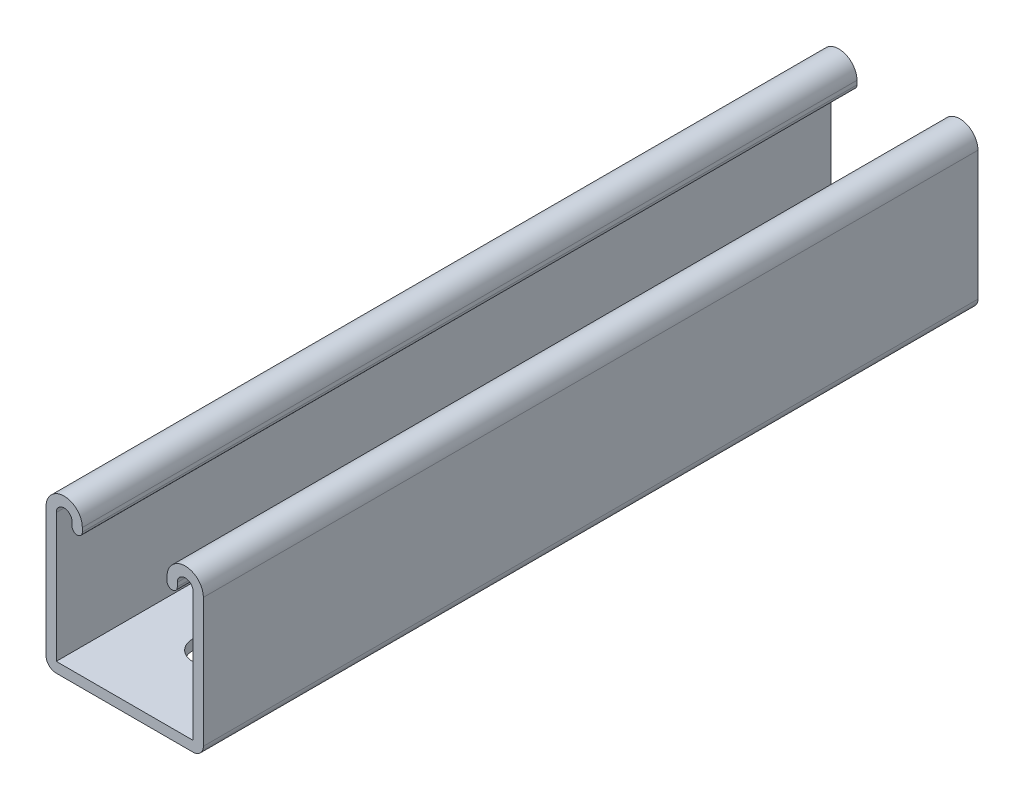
ISO-10303-21;
HEADER;
FILE_DESCRIPTION(('STEP AP214'),'2;1');
FILE_NAME('part.step','',(''),(''),'','','');
FILE_SCHEMA(('AUTOMOTIVE_DESIGN { 1 0 10303 214 1 1 1 1 }'));
ENDSEC;
DATA;
#1=APPLICATION_CONTEXT('core data for automotive mechanical design processes');
#2=APPLICATION_PROTOCOL_DEFINITION('international standard','automotive_design',2000,#1);
#3=PRODUCT_CONTEXT('',#1,'mechanical');
#4=PRODUCT('Part','Part','',(#3));
#5=PRODUCT_RELATED_PRODUCT_CATEGORY('part','',(#4));
#6=PRODUCT_DEFINITION_FORMATION('','',#4);
#7=PRODUCT_DEFINITION_CONTEXT('part definition',#1,'design');
#8=PRODUCT_DEFINITION('design','',#6,#7);
#9=PRODUCT_DEFINITION_SHAPE('','',#8);
#10=(LENGTH_UNIT() NAMED_UNIT(*) SI_UNIT(.MILLI.,.METRE.));
#11=(NAMED_UNIT(*) PLANE_ANGLE_UNIT() SI_UNIT($,.RADIAN.));
#12=(NAMED_UNIT(*) SI_UNIT($,.STERADIAN.) SOLID_ANGLE_UNIT());
#13=UNCERTAINTY_MEASURE_WITH_UNIT(LENGTH_MEASURE(1.E-05),#10,'distance_accuracy_value','');
#14=(GEOMETRIC_REPRESENTATION_CONTEXT(3) GLOBAL_UNCERTAINTY_ASSIGNED_CONTEXT((#13)) GLOBAL_UNIT_ASSIGNED_CONTEXT((#10,
#11,#12)) REPRESENTATION_CONTEXT('',''));
#15=CARTESIAN_POINT('',(0.,0.,0.));
#16=DIRECTION('',(0.,0.,1.));
#17=DIRECTION('',(1.,0.,0.));
#18=AXIS2_PLACEMENT_3D('',#15,#16,#17);
#19=CARTESIAN_POINT('',(-15.875,18.4785,203.2));
#20=DIRECTION('',(0.,0.,-1.));
#21=DIRECTION('',(-1.,0.,0.));
#22=AXIS2_PLACEMENT_3D('',#19,#20,#21);
#23=CYLINDRICAL_SURFACE('',#22,4.7625);
#24=CARTESIAN_POINT('',(-15.875,18.4785,0.));
#25=DIRECTION('',(0.,0.,1.));
#26=DIRECTION('',(-1.,0.,0.));
#27=AXIS2_PLACEMENT_3D('',#24,#25,#26);
#28=CIRCLE('',#27,4.7625);
#29=CARTESIAN_POINT('',(-11.1125,18.4785,0.));
#30=VERTEX_POINT('',#29);
#31=CARTESIAN_POINT('',(-20.6375,18.4785,0.));
#32=VERTEX_POINT('',#31);
#33=EDGE_CURVE('E260',#30,#32,#28,.T.);
#34=ORIENTED_EDGE('',*,*,#33,.T.);
#35=DIRECTION('',(0.,0.,-1.));
#36=VECTOR('',#35,1.);
#37=CARTESIAN_POINT('',(-20.6375,18.4785,203.2));
#38=LINE('',#37,#36);
#39=CARTESIAN_POINT('',(-20.6375,18.4785,203.2));
#40=VERTEX_POINT('',#39);
#41=EDGE_CURVE('E391',#40,#32,#38,.T.);
#42=ORIENTED_EDGE('',*,*,#41,.F.);
#43=CARTESIAN_POINT('',(-15.875,18.4785,203.2));
#44=DIRECTION('',(0.,0.,1.));
#45=DIRECTION('',(-1.,0.,0.));
#46=AXIS2_PLACEMENT_3D('',#43,#44,#45);
#47=CIRCLE('',#46,4.7625);
#48=CARTESIAN_POINT('',(-11.1125,18.4785,203.2));
#49=VERTEX_POINT('',#48);
#50=EDGE_CURVE('E267',#49,#40,#47,.T.);
#51=ORIENTED_EDGE('',*,*,#50,.F.);
#52=DIRECTION('',(0.,0.,-1.));
#53=VECTOR('',#52,1.);
#54=CARTESIAN_POINT('',(-11.1125,18.4785,203.2));
#55=LINE('',#54,#53);
#56=EDGE_CURVE('E305',#49,#30,#55,.T.);
#57=ORIENTED_EDGE('',*,*,#56,.T.);
#58=EDGE_LOOP('',(#34,#42,#51,#57));
#59=FACE_BOUND('',#58,.T.);
#60=ADVANCED_FACE('F39',(#59),#23,.T.);
#61=CARTESIAN_POINT('',(-20.6375,18.4785,203.2));
#62=DIRECTION('',(1.,0.,0.));
#63=DIRECTION('',(0.,1.,0.));
#64=AXIS2_PLACEMENT_3D('',#61,#62,#63);
#65=PLANE('',#64);
#66=DIRECTION('',(0.,-1.,0.));
#67=VECTOR('',#66,1.);
#68=CARTESIAN_POINT('',(-20.6375,18.4785,0.));
#69=LINE('',#68,#67);
#70=CARTESIAN_POINT('',(-20.6375,-15.3416,0.));
#71=VERTEX_POINT('',#70);
#72=EDGE_CURVE('E308',#32,#71,#69,.T.);
#73=ORIENTED_EDGE('',*,*,#72,.T.);
#74=DIRECTION('',(0.,0.,-1.));
#75=VECTOR('',#74,1.);
#76=CARTESIAN_POINT('',(-20.6375,-15.3416,203.2));
#77=LINE('',#76,#75);
#78=CARTESIAN_POINT('',(-20.6375,-15.3416,203.2));
#79=VERTEX_POINT('',#78);
#80=EDGE_CURVE('E388',#79,#71,#77,.T.);
#81=ORIENTED_EDGE('',*,*,#80,.F.);
#82=DIRECTION('',(0.,-1.,0.));
#83=VECTOR('',#82,1.);
#84=CARTESIAN_POINT('',(-20.6375,18.4785,203.2));
#85=LINE('',#84,#83);
#86=EDGE_CURVE('E270',#40,#79,#85,.T.);
#87=ORIENTED_EDGE('',*,*,#86,.F.);
#88=ORIENTED_EDGE('',*,*,#41,.T.);
#89=EDGE_LOOP('',(#73,#81,#87,#88));
#90=FACE_BOUND('',#89,.T.);
#91=ADVANCED_FACE('F433',(#90),#65,.F.);
#92=CARTESIAN_POINT('',(-17.9451,-15.3416,203.2));
#93=DIRECTION('',(0.,0.,-1.));
#94=DIRECTION('',(-1.,0.,0.));
#95=AXIS2_PLACEMENT_3D('',#92,#93,#94);
#96=CYLINDRICAL_SURFACE('',#95,2.6924);
#97=CARTESIAN_POINT('',(-17.9451,-15.3416,0.));
#98=DIRECTION('',(0.,0.,1.));
#99=DIRECTION('',(-1.,0.,0.));
#100=AXIS2_PLACEMENT_3D('',#97,#98,#99);
#101=CIRCLE('',#100,2.6924);
#102=CARTESIAN_POINT('',(-17.9451,-18.034,0.));
#103=VERTEX_POINT('',#102);
#104=EDGE_CURVE('E310',#71,#103,#101,.T.);
#105=ORIENTED_EDGE('',*,*,#104,.T.);
#106=DIRECTION('',(0.,0.,-1.));
#107=VECTOR('',#106,1.);
#108=CARTESIAN_POINT('',(-17.9451,-18.034,203.2));
#109=LINE('',#108,#107);
#110=CARTESIAN_POINT('',(-17.9451,-18.034,203.2));
#111=VERTEX_POINT('',#110);
#112=EDGE_CURVE('E385',#111,#103,#109,.T.);
#113=ORIENTED_EDGE('',*,*,#112,.F.);
#114=CARTESIAN_POINT('',(-17.9451,-15.3416,203.2));
#115=DIRECTION('',(0.,0.,1.));
#116=DIRECTION('',(-1.,0.,0.));
#117=AXIS2_PLACEMENT_3D('',#114,#115,#116);
#118=CIRCLE('',#117,2.6924);
#119=EDGE_CURVE('E273',#79,#111,#118,.T.);
#120=ORIENTED_EDGE('',*,*,#119,.F.);
#121=ORIENTED_EDGE('',*,*,#80,.T.);
#122=EDGE_LOOP('',(#105,#113,#120,#121));
#123=FACE_BOUND('',#122,.T.);
#124=ADVANCED_FACE('F438',(#123),#96,.T.);
#125=CARTESIAN_POINT('',(-17.9451,-18.034,203.2));
#126=DIRECTION('',(0.,1.,0.));
#127=DIRECTION('',(-1.,0.,0.));
#128=AXIS2_PLACEMENT_3D('',#125,#126,#127);
#129=PLANE('',#128);
#130=DIRECTION('',(0.,0.,-1.));
#131=VECTOR('',#130,1.);
#132=CARTESIAN_POINT('',(-5.159375,-18.0340000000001,114.3));
#133=LINE('',#132,#131);
#134=CARTESIAN_POINT('',(-5.15937500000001,-18.034,180.18125));
#135=VERTEX_POINT('',#134);
#136=CARTESIAN_POINT('',(-5.159375,-18.0340000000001,114.3));
#137=VERTEX_POINT('',#136);
#138=EDGE_CURVE('E213',#135,#137,#133,.T.);
#139=ORIENTED_EDGE('',*,*,#138,.F.);
#140=CARTESIAN_POINT('',(0.,-18.0340000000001,180.18125));
#141=DIRECTION('',(0.,-1.,0.));
#142=DIRECTION('',(1.,0.,0.));
#143=AXIS2_PLACEMENT_3D('',#140,#141,#142);
#144=CIRCLE('',#143,5.159375);
#145=CARTESIAN_POINT('',(5.159375,-18.0340000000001,180.18125));
#146=VERTEX_POINT('',#145);
#147=EDGE_CURVE('E53',#146,#135,#144,.T.);
#148=ORIENTED_EDGE('',*,*,#147,.F.);
#149=DIRECTION('',(0.,0.,1.));
#150=VECTOR('',#149,1.);
#151=CARTESIAN_POINT('',(5.159375,-18.0340000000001,180.18125));
#152=LINE('',#151,#150);
#153=CARTESIAN_POINT('',(5.159375,-18.0340000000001,114.3));
#154=VERTEX_POINT('',#153);
#155=EDGE_CURVE('E229',#154,#146,#152,.T.);
#156=ORIENTED_EDGE('',*,*,#155,.F.);
#157=CARTESIAN_POINT('',(0.,-18.0340000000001,114.3));
#158=DIRECTION('',(0.,-1.,0.));
#159=DIRECTION('',(1.,0.,0.));
#160=AXIS2_PLACEMENT_3D('',#157,#158,#159);
#161=CIRCLE('',#160,5.159375);
#162=EDGE_CURVE('E223',#137,#154,#161,.T.);
#163=ORIENTED_EDGE('',*,*,#162,.F.);
#164=EDGE_LOOP('',(#139,#148,#156,#163));
#165=FACE_BOUND('',#164,.T.);
#166=DIRECTION('',(0.,0.,-1.));
#167=VECTOR('',#166,1.);
#168=CARTESIAN_POINT('',(-5.159375,-18.0340000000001,12.7));
#169=LINE('',#168,#167);
#170=CARTESIAN_POINT('',(-5.15937500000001,-18.034,78.58125));
#171=VERTEX_POINT('',#170);
#172=CARTESIAN_POINT('',(-5.159375,-18.0340000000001,12.7));
#173=VERTEX_POINT('',#172);
#174=EDGE_CURVE('E248',#171,#173,#169,.T.);
#175=ORIENTED_EDGE('',*,*,#174,.F.);
#176=CARTESIAN_POINT('',(0.,-18.0340000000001,78.58125));
#177=DIRECTION('',(0.,-1.,0.));
#178=DIRECTION('',(1.,0.,0.));
#179=AXIS2_PLACEMENT_3D('',#176,#177,#178);
#180=CIRCLE('',#179,5.159375);
#181=CARTESIAN_POINT('',(5.159375,-18.0340000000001,78.58125));
#182=VERTEX_POINT('',#181);
#183=EDGE_CURVE('E246',#182,#171,#180,.T.);
#184=ORIENTED_EDGE('',*,*,#183,.F.);
#185=DIRECTION('',(0.,0.,1.));
#186=VECTOR('',#185,1.);
#187=CARTESIAN_POINT('',(5.159375,-18.0340000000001,78.58125));
#188=LINE('',#187,#186);
#189=CARTESIAN_POINT('',(5.159375,-18.0340000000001,12.7));
#190=VERTEX_POINT('',#189);
#191=EDGE_CURVE('E254',#190,#182,#188,.T.);
#192=ORIENTED_EDGE('',*,*,#191,.F.);
#193=CARTESIAN_POINT('',(0.,-18.0340000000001,12.7));
#194=DIRECTION('',(0.,-1.,0.));
#195=DIRECTION('',(1.,0.,0.));
#196=AXIS2_PLACEMENT_3D('',#193,#194,#195);
#197=CIRCLE('',#196,5.159375);
#198=EDGE_CURVE('E251',#173,#190,#197,.T.);
#199=ORIENTED_EDGE('',*,*,#198,.F.);
#200=EDGE_LOOP('',(#175,#184,#192,#199));
#201=FACE_BOUND('',#200,.T.);
#202=DIRECTION('',(1.,0.,0.));
#203=VECTOR('',#202,1.);
#204=CARTESIAN_POINT('',(-17.9451,-18.034,0.));
#205=LINE('',#204,#203);
#206=CARTESIAN_POINT('',(17.9451,-18.034,0.));
#207=VERTEX_POINT('',#206);
#208=EDGE_CURVE('E312',#103,#207,#205,.T.);
#209=ORIENTED_EDGE('',*,*,#208,.T.);
#210=DIRECTION('',(0.,0.,-1.));
#211=VECTOR('',#210,1.);
#212=CARTESIAN_POINT('',(17.9451,-18.034,203.2));
#213=LINE('',#212,#211);
#214=CARTESIAN_POINT('',(17.9451,-18.034,203.2));
#215=VERTEX_POINT('',#214);
#216=EDGE_CURVE('E382',#215,#207,#213,.T.);
#217=ORIENTED_EDGE('',*,*,#216,.F.);
#218=DIRECTION('',(1.,0.,0.));
#219=VECTOR('',#218,1.);
#220=CARTESIAN_POINT('',(-17.9451,-18.034,203.2));
#221=LINE('',#220,#219);
#222=EDGE_CURVE('E275',#111,#215,#221,.T.);
#223=ORIENTED_EDGE('',*,*,#222,.F.);
#224=ORIENTED_EDGE('',*,*,#112,.T.);
#225=EDGE_LOOP('',(#209,#217,#223,#224));
#226=FACE_BOUND('',#225,.T.);
#227=ADVANCED_FACE('F227',(#165,#201,#226),#129,.F.);
#228=CARTESIAN_POINT('',(17.9451,-15.3416,203.2));
#229=DIRECTION('',(0.,0.,-1.));
#230=DIRECTION('',(-1.,0.,0.));
#231=AXIS2_PLACEMENT_3D('',#228,#229,#230);
#232=CYLINDRICAL_SURFACE('',#231,2.6924);
#233=CARTESIAN_POINT('',(17.9451,-15.3416,0.));
#234=DIRECTION('',(0.,0.,1.));
#235=DIRECTION('',(1.,0.,0.));
#236=AXIS2_PLACEMENT_3D('',#233,#234,#235);
#237=CIRCLE('',#236,2.6924);
#238=CARTESIAN_POINT('',(20.6375,-15.3416,0.));
#239=VERTEX_POINT('',#238);
#240=EDGE_CURVE('E314',#207,#239,#237,.T.);
#241=ORIENTED_EDGE('',*,*,#240,.T.);
#242=DIRECTION('',(0.,0.,-1.));
#243=VECTOR('',#242,1.);
#244=CARTESIAN_POINT('',(20.6375,-15.3416,203.2));
#245=LINE('',#244,#243);
#246=CARTESIAN_POINT('',(20.6375,-15.3416,203.2));
#247=VERTEX_POINT('',#246);
#248=EDGE_CURVE('E379',#247,#239,#245,.T.);
#249=ORIENTED_EDGE('',*,*,#248,.F.);
#250=CARTESIAN_POINT('',(17.9451,-15.3416,203.2));
#251=DIRECTION('',(0.,0.,1.));
#252=DIRECTION('',(1.,0.,0.));
#253=AXIS2_PLACEMENT_3D('',#250,#251,#252);
#254=CIRCLE('',#253,2.6924);
#255=EDGE_CURVE('E277',#215,#247,#254,.T.);
#256=ORIENTED_EDGE('',*,*,#255,.F.);
#257=ORIENTED_EDGE('',*,*,#216,.T.);
#258=EDGE_LOOP('',(#241,#249,#256,#257));
#259=FACE_BOUND('',#258,.T.);
#260=ADVANCED_FACE('F518',(#259),#232,.T.);
#261=CARTESIAN_POINT('',(20.6375,-15.3416,203.2));
#262=DIRECTION('',(-1.,0.,0.));
#263=DIRECTION('',(0.,0.,1.));
#264=AXIS2_PLACEMENT_3D('',#261,#262,#263);
#265=PLANE('',#264);
#266=DIRECTION('',(0.,1.,0.));
#267=VECTOR('',#266,1.);
#268=CARTESIAN_POINT('',(20.6375,-15.3416,0.));
#269=LINE('',#268,#267);
#270=CARTESIAN_POINT('',(20.6375,18.4785,0.));
#271=VERTEX_POINT('',#270);
#272=EDGE_CURVE('E316',#239,#271,#269,.T.);
#273=ORIENTED_EDGE('',*,*,#272,.T.);
#274=DIRECTION('',(0.,0.,-1.));
#275=VECTOR('',#274,1.);
#276=CARTESIAN_POINT('',(20.6375,18.4785,203.2));
#277=LINE('',#276,#275);
#278=CARTESIAN_POINT('',(20.6375,18.4785,203.2));
#279=VERTEX_POINT('',#278);
#280=EDGE_CURVE('E376',#279,#271,#277,.T.);
#281=ORIENTED_EDGE('',*,*,#280,.F.);
#282=DIRECTION('',(0.,1.,0.));
#283=VECTOR('',#282,1.);
#284=CARTESIAN_POINT('',(20.6375,-15.3416,203.2));
#285=LINE('',#284,#283);
#286=EDGE_CURVE('E279',#247,#279,#285,.T.);
#287=ORIENTED_EDGE('',*,*,#286,.F.);
#288=ORIENTED_EDGE('',*,*,#248,.T.);
#289=EDGE_LOOP('',(#273,#281,#287,#288));
#290=FACE_BOUND('',#289,.T.);
#291=ADVANCED_FACE('F514',(#290),#265,.F.);
#292=CARTESIAN_POINT('',(15.875,18.4785,203.2));
#293=DIRECTION('',(0.,0.,-1.));
#294=DIRECTION('',(-1.,0.,0.));
#295=AXIS2_PLACEMENT_3D('',#292,#293,#294);
#296=CYLINDRICAL_SURFACE('',#295,4.7625);
#297=CARTESIAN_POINT('',(15.875,18.4785,0.));
#298=DIRECTION('',(0.,0.,1.));
#299=DIRECTION('',(1.,0.,0.));
#300=AXIS2_PLACEMENT_3D('',#297,#298,#299);
#301=CIRCLE('',#300,4.7625);
#302=CARTESIAN_POINT('',(11.1125,18.4785,0.));
#303=VERTEX_POINT('',#302);
#304=EDGE_CURVE('E318',#271,#303,#301,.T.);
#305=ORIENTED_EDGE('',*,*,#304,.T.);
#306=DIRECTION('',(0.,0.,-1.));
#307=VECTOR('',#306,1.);
#308=CARTESIAN_POINT('',(11.1125,18.4785,203.2));
#309=LINE('',#308,#307);
#310=CARTESIAN_POINT('',(11.1125,18.4785,203.2));
#311=VERTEX_POINT('',#310);
#312=EDGE_CURVE('E373',#311,#303,#309,.T.);
#313=ORIENTED_EDGE('',*,*,#312,.F.);
#314=CARTESIAN_POINT('',(15.875,18.4785,203.2));
#315=DIRECTION('',(0.,0.,1.));
#316=DIRECTION('',(1.,0.,0.));
#317=AXIS2_PLACEMENT_3D('',#314,#315,#316);
#318=CIRCLE('',#317,4.7625);
#319=EDGE_CURVE('E281',#279,#311,#318,.T.);
#320=ORIENTED_EDGE('',*,*,#319,.F.);
#321=ORIENTED_EDGE('',*,*,#280,.T.);
#322=EDGE_LOOP('',(#305,#313,#320,#321));
#323=FACE_BOUND('',#322,.T.);
#324=ADVANCED_FACE('F509',(#323),#296,.T.);
#325=CARTESIAN_POINT('',(11.1125,18.4785,203.2));
#326=DIRECTION('',(1.,0.,0.));
#327=DIRECTION('',(0.,1.,0.));
#328=AXIS2_PLACEMENT_3D('',#325,#326,#327);
#329=PLANE('',#328);
#330=DIRECTION('',(0.,-1.,0.));
#331=VECTOR('',#330,1.);
#332=CARTESIAN_POINT('',(11.1125,18.4785,0.));
#333=LINE('',#332,#331);
#334=CARTESIAN_POINT('',(11.1125,17.44345,0.));
#335=VERTEX_POINT('',#334);
#336=EDGE_CURVE('E320',#303,#335,#333,.T.);
#337=ORIENTED_EDGE('',*,*,#336,.T.);
#338=DIRECTION('',(0.,0.,-1.));
#339=VECTOR('',#338,1.);
#340=CARTESIAN_POINT('',(11.1125,17.44345,203.2));
#341=LINE('',#340,#339);
#342=CARTESIAN_POINT('',(11.1125,17.44345,203.2));
#343=VERTEX_POINT('',#342);
#344=EDGE_CURVE('E370',#343,#335,#341,.T.);
#345=ORIENTED_EDGE('',*,*,#344,.F.);
#346=DIRECTION('',(0.,-1.,0.));
#347=VECTOR('',#346,1.);
#348=CARTESIAN_POINT('',(11.1125,18.4785,203.2));
#349=LINE('',#348,#347);
#350=EDGE_CURVE('E283',#311,#343,#349,.T.);
#351=ORIENTED_EDGE('',*,*,#350,.F.);
#352=ORIENTED_EDGE('',*,*,#312,.T.);
#353=EDGE_LOOP('',(#337,#345,#351,#352));
#354=FACE_BOUND('',#353,.T.);
#355=ADVANCED_FACE('F503',(#354),#329,.F.);
#356=CARTESIAN_POINT('',(12.4587,17.44345,203.2));
#357=DIRECTION('',(0.,0.,-1.));
#358=DIRECTION('',(-1.,0.,0.));
#359=AXIS2_PLACEMENT_3D('',#356,#357,#358);
#360=CYLINDRICAL_SURFACE('',#359,1.3462);
#361=CARTESIAN_POINT('',(12.4587,17.44345,0.));
#362=DIRECTION('',(0.,0.,1.));
#363=DIRECTION('',(1.,0.,0.));
#364=AXIS2_PLACEMENT_3D('',#361,#362,#363);
#365=CIRCLE('',#364,1.3462);
#366=CARTESIAN_POINT('',(13.8049,17.44345,0.));
#367=VERTEX_POINT('',#366);
#368=EDGE_CURVE('E322',#335,#367,#365,.T.);
#369=ORIENTED_EDGE('',*,*,#368,.T.);
#370=DIRECTION('',(0.,0.,-1.));
#371=VECTOR('',#370,1.);
#372=CARTESIAN_POINT('',(13.8049,17.44345,203.2));
#373=LINE('',#372,#371);
#374=CARTESIAN_POINT('',(13.8049,17.44345,203.2));
#375=VERTEX_POINT('',#374);
#376=EDGE_CURVE('E367',#375,#367,#373,.T.);
#377=ORIENTED_EDGE('',*,*,#376,.F.);
#378=CARTESIAN_POINT('',(12.4587,17.44345,203.2));
#379=DIRECTION('',(0.,0.,1.));
#380=DIRECTION('',(1.,0.,0.));
#381=AXIS2_PLACEMENT_3D('',#378,#379,#380);
#382=CIRCLE('',#381,1.3462);
#383=EDGE_CURVE('E285',#343,#375,#382,.T.);
#384=ORIENTED_EDGE('',*,*,#383,.F.);
#385=ORIENTED_EDGE('',*,*,#344,.T.);
#386=EDGE_LOOP('',(#369,#377,#384,#385));
#387=FACE_BOUND('',#386,.T.);
#388=ADVANCED_FACE('F499',(#387),#360,.T.);
#389=CARTESIAN_POINT('',(13.8049,18.4785,203.2));
#390=DIRECTION('',(-1.,0.,0.));
#391=DIRECTION('',(0.,0.,1.));
#392=AXIS2_PLACEMENT_3D('',#389,#390,#391);
#393=PLANE('',#392);
#394=DIRECTION('',(0.,1.,0.));
#395=VECTOR('',#394,1.);
#396=CARTESIAN_POINT('',(13.8049,18.4785,0.));
#397=LINE('',#396,#395);
#398=CARTESIAN_POINT('',(13.8049,18.4785,0.));
#399=VERTEX_POINT('',#398);
#400=EDGE_CURVE('E324',#367,#399,#397,.T.);
#401=ORIENTED_EDGE('',*,*,#400,.T.);
#402=DIRECTION('',(0.,0.,-1.));
#403=VECTOR('',#402,1.);
#404=CARTESIAN_POINT('',(13.8049,18.4785,203.2));
#405=LINE('',#404,#403);
#406=CARTESIAN_POINT('',(13.8049,18.4785,203.2));
#407=VERTEX_POINT('',#406);
#408=EDGE_CURVE('E364',#407,#399,#405,.T.);
#409=ORIENTED_EDGE('',*,*,#408,.F.);
#410=DIRECTION('',(0.,1.,0.));
#411=VECTOR('',#410,1.);
#412=CARTESIAN_POINT('',(13.8049,18.4785,203.2));
#413=LINE('',#412,#411);
#414=EDGE_CURVE('E287',#375,#407,#413,.T.);
#415=ORIENTED_EDGE('',*,*,#414,.F.);
#416=ORIENTED_EDGE('',*,*,#376,.T.);
#417=EDGE_LOOP('',(#401,#409,#415,#416));
#418=FACE_BOUND('',#417,.T.);
#419=ADVANCED_FACE('F494',(#418),#393,.F.);
#420=CARTESIAN_POINT('',(15.875,18.4785,203.2));
#421=DIRECTION('',(0.,0.,-1.));
#422=DIRECTION('',(-1.,0.,0.));
#423=AXIS2_PLACEMENT_3D('',#420,#421,#422);
#424=CYLINDRICAL_SURFACE('',#423,2.0701);
#425=CARTESIAN_POINT('',(15.875,18.4785,0.));
#426=DIRECTION('',(0.,0.,-1.));
#427=DIRECTION('',(1.,0.,0.));
#428=AXIS2_PLACEMENT_3D('',#425,#426,#427);
#429=CIRCLE('',#428,2.0701);
#430=CARTESIAN_POINT('',(17.9451,18.4785,0.));
#431=VERTEX_POINT('',#430);
#432=EDGE_CURVE('E326',#399,#431,#429,.T.);
#433=ORIENTED_EDGE('',*,*,#432,.T.);
#434=DIRECTION('',(0.,0.,-1.));
#435=VECTOR('',#434,1.);
#436=CARTESIAN_POINT('',(17.9451,18.4785,203.2));
#437=LINE('',#436,#435);
#438=CARTESIAN_POINT('',(17.9451,18.4785,203.2));
#439=VERTEX_POINT('',#438);
#440=EDGE_CURVE('E361',#439,#431,#437,.T.);
#441=ORIENTED_EDGE('',*,*,#440,.F.);
#442=CARTESIAN_POINT('',(15.875,18.4785,203.2));
#443=DIRECTION('',(0.,0.,-1.));
#444=DIRECTION('',(1.,0.,0.));
#445=AXIS2_PLACEMENT_3D('',#442,#443,#444);
#446=CIRCLE('',#445,2.0701);
#447=EDGE_CURVE('E289',#407,#439,#446,.T.);
#448=ORIENTED_EDGE('',*,*,#447,.F.);
#449=ORIENTED_EDGE('',*,*,#408,.T.);
#450=EDGE_LOOP('',(#433,#441,#448,#449));
#451=FACE_BOUND('',#450,.T.);
#452=ADVANCED_FACE('F488',(#451),#424,.F.);
#453=CARTESIAN_POINT('',(17.9451,-15.3416,203.2));
#454=DIRECTION('',(1.,0.,0.));
#455=DIRECTION('',(0.,1.,0.));
#456=AXIS2_PLACEMENT_3D('',#453,#454,#455);
#457=PLANE('',#456);
#458=DIRECTION('',(0.,-1.,0.));
#459=VECTOR('',#458,1.);
#460=CARTESIAN_POINT('',(17.9451,-15.3416,0.));
#461=LINE('',#460,#459);
#462=CARTESIAN_POINT('',(17.9451,-15.3416,0.));
#463=VERTEX_POINT('',#462);
#464=EDGE_CURVE('E328',#431,#463,#461,.T.);
#465=ORIENTED_EDGE('',*,*,#464,.T.);
#466=DIRECTION('',(0.,0.,-1.));
#467=VECTOR('',#466,1.);
#468=CARTESIAN_POINT('',(17.9451,-15.3416,203.2));
#469=LINE('',#468,#467);
#470=CARTESIAN_POINT('',(17.9451,-15.3416,203.2));
#471=VERTEX_POINT('',#470);
#472=EDGE_CURVE('E358',#471,#463,#469,.T.);
#473=ORIENTED_EDGE('',*,*,#472,.F.);
#474=DIRECTION('',(0.,-1.,0.));
#475=VECTOR('',#474,1.);
#476=CARTESIAN_POINT('',(17.9451,-15.3416,203.2));
#477=LINE('',#476,#475);
#478=EDGE_CURVE('E291',#439,#471,#477,.T.);
#479=ORIENTED_EDGE('',*,*,#478,.F.);
#480=ORIENTED_EDGE('',*,*,#440,.T.);
#481=EDGE_LOOP('',(#465,#473,#479,#480));
#482=FACE_BOUND('',#481,.T.);
#483=ADVANCED_FACE('F484',(#482),#457,.F.);
#484=CARTESIAN_POINT('',(-17.9451,-15.3416,203.2));
#485=DIRECTION('',(0.,-1.,0.));
#486=DIRECTION('',(1.,0.,0.));
#487=AXIS2_PLACEMENT_3D('',#484,#485,#486);
#488=PLANE('',#487);
#489=DIRECTION('',(0.,0.,1.));
#490=VECTOR('',#489,1.);
#491=CARTESIAN_POINT('',(5.159375,-15.3416,304.8));
#492=LINE('',#491,#490);
#493=CARTESIAN_POINT('',(5.159375,-15.3416,114.3));
#494=VERTEX_POINT('',#493);
#495=CARTESIAN_POINT('',(5.159375,-15.3416,180.18125));
#496=VERTEX_POINT('',#495);
#497=EDGE_CURVE('E239',#494,#496,#492,.T.);
#498=ORIENTED_EDGE('',*,*,#497,.T.);
#499=CARTESIAN_POINT('',(0.,-15.3416,180.18125));
#500=DIRECTION('',(0.,-1.,0.));
#501=DIRECTION('',(1.,0.,0.));
#502=AXIS2_PLACEMENT_3D('',#499,#500,#501);
#503=CIRCLE('',#502,5.159375);
#504=CARTESIAN_POINT('',(-5.15937500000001,-15.3416,180.18125));
#505=VERTEX_POINT('',#504);
#506=EDGE_CURVE('E243',#496,#505,#503,.T.);
#507=ORIENTED_EDGE('',*,*,#506,.T.);
#508=DIRECTION('',(0.,0.,-1.));
#509=VECTOR('',#508,1.);
#510=CARTESIAN_POINT('',(-5.15937500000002,-15.3416,304.8));
#511=LINE('',#510,#509);
#512=CARTESIAN_POINT('',(-5.159375,-15.3416,114.3));
#513=VERTEX_POINT('',#512);
#514=EDGE_CURVE('E220',#505,#513,#511,.T.);
#515=ORIENTED_EDGE('',*,*,#514,.T.);
#516=CARTESIAN_POINT('',(0.,-15.3416,114.3));
#517=DIRECTION('',(0.,-1.,0.));
#518=DIRECTION('',(1.,0.,0.));
#519=AXIS2_PLACEMENT_3D('',#516,#517,#518);
#520=CIRCLE('',#519,5.159375);
#521=EDGE_CURVE('E61',#513,#494,#520,.T.);
#522=ORIENTED_EDGE('',*,*,#521,.T.);
#523=EDGE_LOOP('',(#498,#507,#515,#522));
#524=FACE_BOUND('',#523,.T.);
#525=DIRECTION('',(0.,0.,1.));
#526=VECTOR('',#525,1.);
#527=CARTESIAN_POINT('',(5.159375,-15.3416,203.2));
#528=LINE('',#527,#526);
#529=CARTESIAN_POINT('',(5.159375,-15.3416,12.7));
#530=VERTEX_POINT('',#529);
#531=CARTESIAN_POINT('',(5.159375,-15.3416,78.58125));
#532=VERTEX_POINT('',#531);
#533=EDGE_CURVE('E46',#530,#532,#528,.T.);
#534=ORIENTED_EDGE('',*,*,#533,.T.);
#535=CARTESIAN_POINT('',(0.,-15.3416,78.58125));
#536=DIRECTION('',(0.,-1.,0.));
#537=DIRECTION('',(1.,0.,0.));
#538=AXIS2_PLACEMENT_3D('',#535,#536,#537);
#539=CIRCLE('',#538,5.159375);
#540=CARTESIAN_POINT('',(-5.15937500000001,-15.3416,78.58125));
#541=VERTEX_POINT('',#540);
#542=EDGE_CURVE('E11',#532,#541,#539,.T.);
#543=ORIENTED_EDGE('',*,*,#542,.T.);
#544=DIRECTION('',(0.,0.,-1.));
#545=VECTOR('',#544,1.);
#546=CARTESIAN_POINT('',(-5.15937500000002,-15.3416,203.2));
#547=LINE('',#546,#545);
#548=CARTESIAN_POINT('',(-5.159375,-15.3416,12.7));
#549=VERTEX_POINT('',#548);
#550=EDGE_CURVE('E394',#541,#549,#547,.T.);
#551=ORIENTED_EDGE('',*,*,#550,.T.);
#552=CARTESIAN_POINT('',(0.,-15.3416,12.7));
#553=DIRECTION('',(0.,-1.,0.));
#554=DIRECTION('',(1.,0.,0.));
#555=AXIS2_PLACEMENT_3D('',#552,#553,#554);
#556=CIRCLE('',#555,5.159375);
#557=EDGE_CURVE('E397',#549,#530,#556,.T.);
#558=ORIENTED_EDGE('',*,*,#557,.T.);
#559=EDGE_LOOP('',(#534,#543,#551,#558));
#560=FACE_BOUND('',#559,.T.);
#561=DIRECTION('',(-1.,0.,0.));
#562=VECTOR('',#561,1.);
#563=CARTESIAN_POINT('',(-17.9451,-15.3416,0.));
#564=LINE('',#563,#562);
#565=CARTESIAN_POINT('',(-17.9451,-15.3416,0.));
#566=VERTEX_POINT('',#565);
#567=EDGE_CURVE('E330',#463,#566,#564,.T.);
#568=ORIENTED_EDGE('',*,*,#567,.T.);
#569=DIRECTION('',(0.,0.,-1.));
#570=VECTOR('',#569,1.);
#571=CARTESIAN_POINT('',(-17.9451,-15.3416,203.2));
#572=LINE('',#571,#570);
#573=CARTESIAN_POINT('',(-17.9451,-15.3416,203.2));
#574=VERTEX_POINT('',#573);
#575=EDGE_CURVE('E355',#574,#566,#572,.T.);
#576=ORIENTED_EDGE('',*,*,#575,.F.);
#577=DIRECTION('',(-1.,0.,0.));
#578=VECTOR('',#577,1.);
#579=CARTESIAN_POINT('',(-17.9451,-15.3416,203.2));
#580=LINE('',#579,#578);
#581=EDGE_CURVE('E293',#471,#574,#580,.T.);
#582=ORIENTED_EDGE('',*,*,#581,.F.);
#583=ORIENTED_EDGE('',*,*,#472,.T.);
#584=EDGE_LOOP('',(#568,#576,#582,#583));
#585=FACE_BOUND('',#584,.T.);
#586=ADVANCED_FACE('F401',(#524,#560,#585),#488,.F.);
#587=CARTESIAN_POINT('',(-17.9451,18.4785,203.2));
#588=DIRECTION('',(-1.,0.,0.));
#589=DIRECTION('',(0.,-1.,0.));
#590=AXIS2_PLACEMENT_3D('',#587,#588,#589);
#591=PLANE('',#590);
#592=DIRECTION('',(0.,1.,0.));
#593=VECTOR('',#592,1.);
#594=CARTESIAN_POINT('',(-17.9451,18.4785,0.));
#595=LINE('',#594,#593);
#596=CARTESIAN_POINT('',(-17.9451,18.4785,0.));
#597=VERTEX_POINT('',#596);
#598=EDGE_CURVE('E332',#566,#597,#595,.T.);
#599=ORIENTED_EDGE('',*,*,#598,.T.);
#600=DIRECTION('',(0.,0.,-1.));
#601=VECTOR('',#600,1.);
#602=CARTESIAN_POINT('',(-17.9451,18.4785,203.2));
#603=LINE('',#602,#601);
#604=CARTESIAN_POINT('',(-17.9451,18.4785,203.2));
#605=VERTEX_POINT('',#604);
#606=EDGE_CURVE('E352',#605,#597,#603,.T.);
#607=ORIENTED_EDGE('',*,*,#606,.F.);
#608=DIRECTION('',(0.,1.,0.));
#609=VECTOR('',#608,1.);
#610=CARTESIAN_POINT('',(-17.9451,18.4785,203.2));
#611=LINE('',#610,#609);
#612=EDGE_CURVE('E295',#574,#605,#611,.T.);
#613=ORIENTED_EDGE('',*,*,#612,.F.);
#614=ORIENTED_EDGE('',*,*,#575,.T.);
#615=EDGE_LOOP('',(#599,#607,#613,#614));
#616=FACE_BOUND('',#615,.T.);
#617=ADVANCED_FACE('F475',(#616),#591,.F.);
#618=CARTESIAN_POINT('',(-15.875,18.4785,203.2));
#619=DIRECTION('',(0.,0.,-1.));
#620=DIRECTION('',(-1.,0.,0.));
#621=AXIS2_PLACEMENT_3D('',#618,#619,#620);
#622=CYLINDRICAL_SURFACE('',#621,2.0701);
#623=CARTESIAN_POINT('',(-15.875,18.4785,0.));
#624=DIRECTION('',(0.,0.,-1.));
#625=DIRECTION('',(-1.,0.,0.));
#626=AXIS2_PLACEMENT_3D('',#623,#624,#625);
#627=CIRCLE('',#626,2.0701);
#628=CARTESIAN_POINT('',(-13.8049,18.4785,0.));
#629=VERTEX_POINT('',#628);
#630=EDGE_CURVE('E334',#597,#629,#627,.T.);
#631=ORIENTED_EDGE('',*,*,#630,.T.);
#632=DIRECTION('',(0.,0.,-1.));
#633=VECTOR('',#632,1.);
#634=CARTESIAN_POINT('',(-13.8049,18.4785,203.2));
#635=LINE('',#634,#633);
#636=CARTESIAN_POINT('',(-13.8049,18.4785,203.2));
#637=VERTEX_POINT('',#636);
#638=EDGE_CURVE('E349',#637,#629,#635,.T.);
#639=ORIENTED_EDGE('',*,*,#638,.F.);
#640=CARTESIAN_POINT('',(-15.875,18.4785,203.2));
#641=DIRECTION('',(0.,0.,-1.));
#642=DIRECTION('',(-1.,0.,0.));
#643=AXIS2_PLACEMENT_3D('',#640,#641,#642);
#644=CIRCLE('',#643,2.0701);
#645=EDGE_CURVE('E297',#605,#637,#644,.T.);
#646=ORIENTED_EDGE('',*,*,#645,.F.);
#647=ORIENTED_EDGE('',*,*,#606,.T.);
#648=EDGE_LOOP('',(#631,#639,#646,#647));
#649=FACE_BOUND('',#648,.T.);
#650=ADVANCED_FACE('F471',(#649),#622,.F.);
#651=CARTESIAN_POINT('',(-13.8049,18.4785,203.2));
#652=DIRECTION('',(1.,0.,0.));
#653=DIRECTION('',(0.,1.,0.));
#654=AXIS2_PLACEMENT_3D('',#651,#652,#653);
#655=PLANE('',#654);
#656=DIRECTION('',(0.,-1.,0.));
#657=VECTOR('',#656,1.);
#658=CARTESIAN_POINT('',(-13.8049,18.4785,0.));
#659=LINE('',#658,#657);
#660=CARTESIAN_POINT('',(-13.8049,17.44345,0.));
#661=VERTEX_POINT('',#660);
#662=EDGE_CURVE('E336',#629,#661,#659,.T.);
#663=ORIENTED_EDGE('',*,*,#662,.T.);
#664=DIRECTION('',(0.,0.,-1.));
#665=VECTOR('',#664,1.);
#666=CARTESIAN_POINT('',(-13.8049,17.44345,203.2));
#667=LINE('',#666,#665);
#668=CARTESIAN_POINT('',(-13.8049,17.44345,203.2));
#669=VERTEX_POINT('',#668);
#670=EDGE_CURVE('E346',#669,#661,#667,.T.);
#671=ORIENTED_EDGE('',*,*,#670,.F.);
#672=DIRECTION('',(0.,-1.,0.));
#673=VECTOR('',#672,1.);
#674=CARTESIAN_POINT('',(-13.8049,18.4785,203.2));
#675=LINE('',#674,#673);
#676=EDGE_CURVE('E299',#637,#669,#675,.T.);
#677=ORIENTED_EDGE('',*,*,#676,.F.);
#678=ORIENTED_EDGE('',*,*,#638,.T.);
#679=EDGE_LOOP('',(#663,#671,#677,#678));
#680=FACE_BOUND('',#679,.T.);
#681=ADVANCED_FACE('F466',(#680),#655,.F.);
#682=CARTESIAN_POINT('',(-12.4587,17.44345,203.2));
#683=DIRECTION('',(0.,0.,-1.));
#684=DIRECTION('',(-1.,0.,0.));
#685=AXIS2_PLACEMENT_3D('',#682,#683,#684);
#686=CYLINDRICAL_SURFACE('',#685,1.3462);
#687=CARTESIAN_POINT('',(-12.4587,17.44345,0.));
#688=DIRECTION('',(0.,0.,1.));
#689=DIRECTION('',(-1.,0.,0.));
#690=AXIS2_PLACEMENT_3D('',#687,#688,#689);
#691=CIRCLE('',#690,1.3462);
#692=CARTESIAN_POINT('',(-11.1125,17.44345,0.));
#693=VERTEX_POINT('',#692);
#694=EDGE_CURVE('E338',#661,#693,#691,.T.);
#695=ORIENTED_EDGE('',*,*,#694,.T.);
#696=DIRECTION('',(0.,0.,-1.));
#697=VECTOR('',#696,1.);
#698=CARTESIAN_POINT('',(-11.1125,17.44345,203.2));
#699=LINE('',#698,#697);
#700=CARTESIAN_POINT('',(-11.1125,17.44345,203.2));
#701=VERTEX_POINT('',#700);
#702=EDGE_CURVE('E343',#701,#693,#699,.T.);
#703=ORIENTED_EDGE('',*,*,#702,.F.);
#704=CARTESIAN_POINT('',(-12.4587,17.44345,203.2));
#705=DIRECTION('',(0.,0.,1.));
#706=DIRECTION('',(-1.,0.,0.));
#707=AXIS2_PLACEMENT_3D('',#704,#705,#706);
#708=CIRCLE('',#707,1.3462);
#709=EDGE_CURVE('E301',#669,#701,#708,.T.);
#710=ORIENTED_EDGE('',*,*,#709,.F.);
#711=ORIENTED_EDGE('',*,*,#670,.T.);
#712=EDGE_LOOP('',(#695,#703,#710,#711));
#713=FACE_BOUND('',#712,.T.);
#714=ADVANCED_FACE('F460',(#713),#686,.T.);
#715=CARTESIAN_POINT('',(-11.1125,18.4785,203.2));
#716=DIRECTION('',(-1.,0.,0.));
#717=DIRECTION('',(0.,0.,1.));
#718=AXIS2_PLACEMENT_3D('',#715,#716,#717);
#719=PLANE('',#718);
#720=DIRECTION('',(0.,1.,0.));
#721=VECTOR('',#720,1.);
#722=CARTESIAN_POINT('',(-11.1125,18.4785,0.));
#723=LINE('',#722,#721);
#724=EDGE_CURVE('E271',#693,#30,#723,.T.);
#725=ORIENTED_EDGE('',*,*,#724,.T.);
#726=ORIENTED_EDGE('',*,*,#56,.F.);
#727=DIRECTION('',(0.,1.,0.));
#728=VECTOR('',#727,1.);
#729=CARTESIAN_POINT('',(-11.1125,18.4785,203.2));
#730=LINE('',#729,#728);
#731=EDGE_CURVE('E303',#701,#49,#730,.T.);
#732=ORIENTED_EDGE('',*,*,#731,.F.);
#733=ORIENTED_EDGE('',*,*,#702,.T.);
#734=EDGE_LOOP('',(#725,#726,#732,#733));
#735=FACE_BOUND('',#734,.T.);
#736=ADVANCED_FACE('F458',(#735),#719,.F.);
#737=CARTESIAN_POINT('',(-15.875,18.4785,203.2));
#738=DIRECTION('',(0.,0.,-1.));
#739=DIRECTION('',(-1.,0.,0.));
#740=AXIS2_PLACEMENT_3D('',#737,#738,#739);
#741=PLANE('',#740);
#742=ORIENTED_EDGE('',*,*,#50,.T.);
#743=ORIENTED_EDGE('',*,*,#86,.T.);
#744=ORIENTED_EDGE('',*,*,#119,.T.);
#745=ORIENTED_EDGE('',*,*,#222,.T.);
#746=ORIENTED_EDGE('',*,*,#255,.T.);
#747=ORIENTED_EDGE('',*,*,#286,.T.);
#748=ORIENTED_EDGE('',*,*,#319,.T.);
#749=ORIENTED_EDGE('',*,*,#350,.T.);
#750=ORIENTED_EDGE('',*,*,#383,.T.);
#751=ORIENTED_EDGE('',*,*,#414,.T.);
#752=ORIENTED_EDGE('',*,*,#447,.T.);
#753=ORIENTED_EDGE('',*,*,#478,.T.);
#754=ORIENTED_EDGE('',*,*,#581,.T.);
#755=ORIENTED_EDGE('',*,*,#612,.T.);
#756=ORIENTED_EDGE('',*,*,#645,.T.);
#757=ORIENTED_EDGE('',*,*,#676,.T.);
#758=ORIENTED_EDGE('',*,*,#709,.T.);
#759=ORIENTED_EDGE('',*,*,#731,.T.);
#760=EDGE_LOOP('',(#742,#743,#744,#745,#746,#747,#748,#749,#750,#751,#752,#753,#754,#755,#756,
#757,#758,#759));
#761=FACE_BOUND('',#760,.T.);
#762=ADVANCED_FACE('F453',(#761),#741,.F.);
#763=CARTESIAN_POINT('',(-15.875,18.4785,0.));
#764=DIRECTION('',(0.,0.,-1.));
#765=DIRECTION('',(-1.,0.,0.));
#766=AXIS2_PLACEMENT_3D('',#763,#764,#765);
#767=PLANE('',#766);
#768=ORIENTED_EDGE('',*,*,#33,.F.);
#769=ORIENTED_EDGE('',*,*,#724,.F.);
#770=ORIENTED_EDGE('',*,*,#694,.F.);
#771=ORIENTED_EDGE('',*,*,#662,.F.);
#772=ORIENTED_EDGE('',*,*,#630,.F.);
#773=ORIENTED_EDGE('',*,*,#598,.F.);
#774=ORIENTED_EDGE('',*,*,#567,.F.);
#775=ORIENTED_EDGE('',*,*,#464,.F.);
#776=ORIENTED_EDGE('',*,*,#432,.F.);
#777=ORIENTED_EDGE('',*,*,#400,.F.);
#778=ORIENTED_EDGE('',*,*,#368,.F.);
#779=ORIENTED_EDGE('',*,*,#336,.F.);
#780=ORIENTED_EDGE('',*,*,#304,.F.);
#781=ORIENTED_EDGE('',*,*,#272,.F.);
#782=ORIENTED_EDGE('',*,*,#240,.F.);
#783=ORIENTED_EDGE('',*,*,#208,.F.);
#784=ORIENTED_EDGE('',*,*,#104,.F.);
#785=ORIENTED_EDGE('',*,*,#72,.F.);
#786=EDGE_LOOP('',(#768,#769,#770,#771,#772,#773,#774,#775,#776,#777,#778,#779,#780,#781,#782,
#783,#784,#785));
#787=FACE_BOUND('',#786,.T.);
#788=ADVANCED_FACE('F446',(#787),#767,.T.);
#789=CARTESIAN_POINT('',(0.,23.241,78.58125));
#790=DIRECTION('',(0.,-1.,0.));
#791=DIRECTION('',(1.,0.,0.));
#792=AXIS2_PLACEMENT_3D('',#789,#790,#791);
#793=CYLINDRICAL_SURFACE('',#792,5.159375);
#794=DIRECTION('',(0.,-1.,0.));
#795=VECTOR('',#794,1.);
#796=CARTESIAN_POINT('',(5.159375,23.241,78.58125));
#797=LINE('',#796,#795);
#798=EDGE_CURVE('E258',#532,#182,#797,.T.);
#799=ORIENTED_EDGE('',*,*,#798,.T.);
#800=ORIENTED_EDGE('',*,*,#183,.T.);
#801=DIRECTION('',(0.,-1.,0.));
#802=VECTOR('',#801,1.);
#803=CARTESIAN_POINT('',(-5.15937500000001,23.241,78.58125));
#804=LINE('',#803,#802);
#805=EDGE_CURVE('E257',#541,#171,#804,.T.);
#806=ORIENTED_EDGE('',*,*,#805,.F.);
#807=ORIENTED_EDGE('',*,*,#542,.F.);
#808=EDGE_LOOP('',(#799,#800,#806,#807));
#809=FACE_BOUND('',#808,.T.);
#810=ADVANCED_FACE('F417',(#809),#793,.F.);
#811=CARTESIAN_POINT('',(5.159375,23.241,78.58125));
#812=DIRECTION('',(1.,0.,0.));
#813=DIRECTION('',(0.,1.,0.));
#814=AXIS2_PLACEMENT_3D('',#811,#812,#813);
#815=PLANE('',#814);
#816=DIRECTION('',(0.,-1.,0.));
#817=VECTOR('',#816,1.);
#818=CARTESIAN_POINT('',(5.159375,23.241,12.7));
#819=LINE('',#818,#817);
#820=EDGE_CURVE('E261',#530,#190,#819,.T.);
#821=ORIENTED_EDGE('',*,*,#820,.T.);
#822=ORIENTED_EDGE('',*,*,#191,.T.);
#823=ORIENTED_EDGE('',*,*,#798,.F.);
#824=ORIENTED_EDGE('',*,*,#533,.F.);
#825=EDGE_LOOP('',(#821,#822,#823,#824));
#826=FACE_BOUND('',#825,.T.);
#827=ADVANCED_FACE('F407',(#826),#815,.F.);
#828=CARTESIAN_POINT('',(0.,23.241,12.7));
#829=DIRECTION('',(0.,-1.,0.));
#830=DIRECTION('',(1.,0.,0.));
#831=AXIS2_PLACEMENT_3D('',#828,#829,#830);
#832=CYLINDRICAL_SURFACE('',#831,5.159375);
#833=DIRECTION('',(0.,-1.,0.));
#834=VECTOR('',#833,1.);
#835=CARTESIAN_POINT('',(-5.159375,23.241,12.7));
#836=LINE('',#835,#834);
#837=EDGE_CURVE('E263',#549,#173,#836,.T.);
#838=ORIENTED_EDGE('',*,*,#837,.T.);
#839=ORIENTED_EDGE('',*,*,#198,.T.);
#840=ORIENTED_EDGE('',*,*,#820,.F.);
#841=ORIENTED_EDGE('',*,*,#557,.F.);
#842=EDGE_LOOP('',(#838,#839,#840,#841));
#843=FACE_BOUND('',#842,.T.);
#844=ADVANCED_FACE('F409',(#843),#832,.F.);
#845=CARTESIAN_POINT('',(-5.159375,23.241,12.7));
#846=DIRECTION('',(-1.,0.,0.));
#847=DIRECTION('',(0.,-1.,0.));
#848=AXIS2_PLACEMENT_3D('',#845,#846,#847);
#849=PLANE('',#848);
#850=ORIENTED_EDGE('',*,*,#805,.T.);
#851=ORIENTED_EDGE('',*,*,#174,.T.);
#852=ORIENTED_EDGE('',*,*,#837,.F.);
#853=ORIENTED_EDGE('',*,*,#550,.F.);
#854=EDGE_LOOP('',(#850,#851,#852,#853));
#855=FACE_BOUND('',#854,.T.);
#856=ADVANCED_FACE('F419',(#855),#849,.F.);
#857=CARTESIAN_POINT('',(0.,23.241,180.18125));
#858=DIRECTION('',(0.,-1.,0.));
#859=DIRECTION('',(1.,0.,0.));
#860=AXIS2_PLACEMENT_3D('',#857,#858,#859);
#861=CYLINDRICAL_SURFACE('',#860,5.159375);
#862=DIRECTION('',(0.,-1.,0.));
#863=VECTOR('',#862,1.);
#864=CARTESIAN_POINT('',(5.159375,23.241,180.18125));
#865=LINE('',#864,#863);
#866=EDGE_CURVE('E237',#496,#146,#865,.T.);
#867=ORIENTED_EDGE('',*,*,#866,.T.);
#868=ORIENTED_EDGE('',*,*,#147,.T.);
#869=DIRECTION('',(0.,-1.,0.));
#870=VECTOR('',#869,1.);
#871=CARTESIAN_POINT('',(-5.15937500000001,23.241,180.18125));
#872=LINE('',#871,#870);
#873=EDGE_CURVE('E217',#505,#135,#872,.T.);
#874=ORIENTED_EDGE('',*,*,#873,.F.);
#875=ORIENTED_EDGE('',*,*,#506,.F.);
#876=EDGE_LOOP('',(#867,#868,#874,#875));
#877=FACE_BOUND('',#876,.T.);
#878=ADVANCED_FACE('F421',(#877),#861,.F.);
#879=CARTESIAN_POINT('',(5.159375,23.241,180.18125));
#880=DIRECTION('',(1.,0.,0.));
#881=DIRECTION('',(0.,1.,0.));
#882=AXIS2_PLACEMENT_3D('',#879,#880,#881);
#883=PLANE('',#882);
#884=DIRECTION('',(0.,-1.,0.));
#885=VECTOR('',#884,1.);
#886=CARTESIAN_POINT('',(5.159375,23.241,114.3));
#887=LINE('',#886,#885);
#888=EDGE_CURVE('E230',#494,#154,#887,.T.);
#889=ORIENTED_EDGE('',*,*,#888,.T.);
#890=ORIENTED_EDGE('',*,*,#155,.T.);
#891=ORIENTED_EDGE('',*,*,#866,.F.);
#892=ORIENTED_EDGE('',*,*,#497,.F.);
#893=EDGE_LOOP('',(#889,#890,#891,#892));
#894=FACE_BOUND('',#893,.T.);
#895=ADVANCED_FACE('F428',(#894),#883,.F.);
#896=CARTESIAN_POINT('',(0.,23.241,114.3));
#897=DIRECTION('',(0.,-1.,0.));
#898=DIRECTION('',(1.,0.,0.));
#899=AXIS2_PLACEMENT_3D('',#896,#897,#898);
#900=CYLINDRICAL_SURFACE('',#899,5.159375);
#901=DIRECTION('',(0.,-1.,0.));
#902=VECTOR('',#901,1.);
#903=CARTESIAN_POINT('',(-5.159375,23.241,114.3));
#904=LINE('',#903,#902);
#905=EDGE_CURVE('E215',#513,#137,#904,.T.);
#906=ORIENTED_EDGE('',*,*,#905,.T.);
#907=ORIENTED_EDGE('',*,*,#162,.T.);
#908=ORIENTED_EDGE('',*,*,#888,.F.);
#909=ORIENTED_EDGE('',*,*,#521,.F.);
#910=EDGE_LOOP('',(#906,#907,#908,#909));
#911=FACE_BOUND('',#910,.T.);
#912=ADVANCED_FACE('F222',(#911),#900,.F.);
#913=CARTESIAN_POINT('',(-5.159375,23.241,114.3));
#914=DIRECTION('',(-1.,0.,0.));
#915=DIRECTION('',(0.,-1.,0.));
#916=AXIS2_PLACEMENT_3D('',#913,#914,#915);
#917=PLANE('',#916);
#918=ORIENTED_EDGE('',*,*,#873,.T.);
#919=ORIENTED_EDGE('',*,*,#138,.T.);
#920=ORIENTED_EDGE('',*,*,#905,.F.);
#921=ORIENTED_EDGE('',*,*,#514,.F.);
#922=EDGE_LOOP('',(#918,#919,#920,#921));
#923=FACE_BOUND('',#922,.T.);
#924=ADVANCED_FACE('F214',(#923),#917,.F.);
#925=CLOSED_SHELL('',(#60,#91,#124,#227,#260,#291,#324,#355,#388,#419,#452,#483,#586,#617,#650,
#681,#714,#736,#762,#788,#810,#827,#844,#856,#878,#895,#912,#924));
#926=MANIFOLD_SOLID_BREP('B2',#925);
#927=ADVANCED_BREP_SHAPE_REPRESENTATION('',(#18,#926),#14);
#928=SHAPE_DEFINITION_REPRESENTATION(#9,#927);
ENDSEC;
END-ISO-10303-21;
